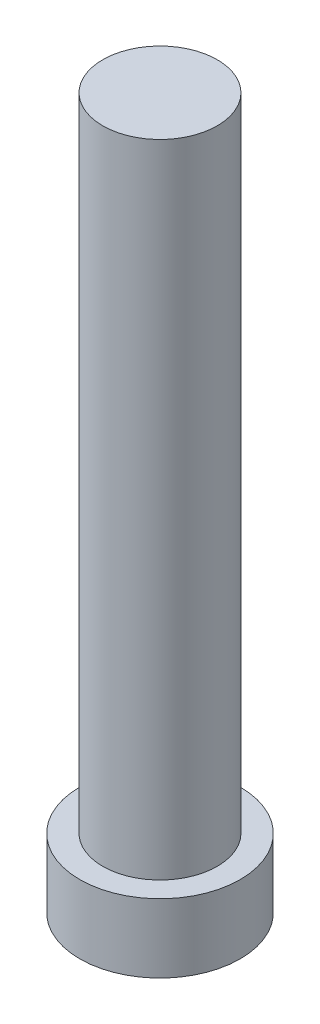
ISO-10303-21;
HEADER;
FILE_DESCRIPTION(('STEP AP214'),'2;1');
FILE_NAME('part.step','',(''),(''),'','','');
FILE_SCHEMA(('AUTOMOTIVE_DESIGN { 1 0 10303 214 1 1 1 1 }'));
ENDSEC;
DATA;
#1=APPLICATION_CONTEXT('core data for automotive mechanical design processes');
#2=APPLICATION_PROTOCOL_DEFINITION('international standard','automotive_design',2000,#1);
#3=PRODUCT_CONTEXT('',#1,'mechanical');
#4=PRODUCT('Part','Part','',(#3));
#5=PRODUCT_RELATED_PRODUCT_CATEGORY('part','',(#4));
#6=PRODUCT_DEFINITION_FORMATION('','',#4);
#7=PRODUCT_DEFINITION_CONTEXT('part definition',#1,'design');
#8=PRODUCT_DEFINITION('design','',#6,#7);
#9=PRODUCT_DEFINITION_SHAPE('','',#8);
#10=(LENGTH_UNIT() NAMED_UNIT(*) SI_UNIT(.MILLI.,.METRE.));
#11=(NAMED_UNIT(*) PLANE_ANGLE_UNIT() SI_UNIT($,.RADIAN.));
#12=(NAMED_UNIT(*) SI_UNIT($,.STERADIAN.) SOLID_ANGLE_UNIT());
#13=UNCERTAINTY_MEASURE_WITH_UNIT(LENGTH_MEASURE(1.E-05),#10,'distance_accuracy_value','');
#14=(GEOMETRIC_REPRESENTATION_CONTEXT(3) GLOBAL_UNCERTAINTY_ASSIGNED_CONTEXT((#13)) GLOBAL_UNIT_ASSIGNED_CONTEXT((#10,
#11,#12)) REPRESENTATION_CONTEXT('',''));
#15=CARTESIAN_POINT('',(0.,0.,0.));
#16=DIRECTION('',(0.,0.,1.));
#17=DIRECTION('',(1.,0.,0.));
#18=AXIS2_PLACEMENT_3D('',#15,#16,#17);
#19=CARTESIAN_POINT('',(-4.99999999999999,62.,0.));
#20=DIRECTION('',(0.,1.,0.));
#21=DIRECTION('',(0.,0.,1.));
#22=AXIS2_PLACEMENT_3D('',#19,#20,#21);
#23=PLANE('',#22);
#24=CARTESIAN_POINT('',(0.,62.,0.));
#25=DIRECTION('',(0.,1.,0.));
#26=DIRECTION('',(0.,0.,1.));
#27=AXIS2_PLACEMENT_3D('',#24,#25,#26);
#28=CIRCLE('',#27,4.99999999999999);
#29=CARTESIAN_POINT('',(0.,62.,4.99999999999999));
#30=VERTEX_POINT('',#29);
#31=EDGE_CURVE('E10',#30,#30,#28,.T.);
#32=ORIENTED_EDGE('',*,*,#31,.T.);
#33=EDGE_LOOP('',(#32));
#34=FACE_BOUND('',#33,.T.);
#35=ADVANCED_FACE('F30',(#34),#23,.T.);
#36=CARTESIAN_POINT('',(0.,49.4323076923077,0.));
#37=DIRECTION('',(0.,1.,0.));
#38=DIRECTION('',(0.,0.,1.));
#39=AXIS2_PLACEMENT_3D('',#36,#37,#38);
#40=CYLINDRICAL_SURFACE('',#39,4.99999999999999);
#41=CARTESIAN_POINT('',(0.,6.,0.));
#42=DIRECTION('',(0.,1.,0.));
#43=DIRECTION('',(0.,0.,1.));
#44=AXIS2_PLACEMENT_3D('',#41,#42,#43);
#45=CIRCLE('',#44,4.99999999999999);
#46=CARTESIAN_POINT('',(0.,6.,4.99999999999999));
#47=VERTEX_POINT('',#46);
#48=EDGE_CURVE('E36',#47,#47,#45,.T.);
#49=ORIENTED_EDGE('',*,*,#48,.T.);
#50=EDGE_LOOP('',(#49));
#51=FACE_BOUND('',#50,.T.);
#52=ORIENTED_EDGE('',*,*,#31,.F.);
#53=EDGE_LOOP('',(#52));
#54=FACE_BOUND('',#53,.T.);
#55=ADVANCED_FACE('F62',(#51,#54),#40,.T.);
#56=CARTESIAN_POINT('',(-7.,6.,0.));
#57=DIRECTION('',(0.,1.,0.));
#58=DIRECTION('',(0.,0.,1.));
#59=AXIS2_PLACEMENT_3D('',#56,#57,#58);
#60=PLANE('',#59);
#61=CARTESIAN_POINT('',(0.,6.,0.));
#62=DIRECTION('',(0.,1.,0.));
#63=DIRECTION('',(0.,0.,1.));
#64=AXIS2_PLACEMENT_3D('',#61,#62,#63);
#65=CIRCLE('',#64,7.);
#66=CARTESIAN_POINT('',(0.,6.,7.));
#67=VERTEX_POINT('',#66);
#68=EDGE_CURVE('E40',#67,#67,#65,.T.);
#69=ORIENTED_EDGE('',*,*,#68,.T.);
#70=EDGE_LOOP('',(#69));
#71=FACE_BOUND('',#70,.T.);
#72=ORIENTED_EDGE('',*,*,#48,.F.);
#73=EDGE_LOOP('',(#72));
#74=FACE_BOUND('',#73,.T.);
#75=ADVANCED_FACE('F59',(#71,#74),#60,.T.);
#76=CARTESIAN_POINT('',(0.,49.4323076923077,0.));
#77=DIRECTION('',(0.,1.,0.));
#78=DIRECTION('',(0.,0.,1.));
#79=AXIS2_PLACEMENT_3D('',#76,#77,#78);
#80=CYLINDRICAL_SURFACE('',#79,7.);
#81=CARTESIAN_POINT('',(0.,0.,0.));
#82=DIRECTION('',(0.,1.,0.));
#83=DIRECTION('',(0.,0.,1.));
#84=AXIS2_PLACEMENT_3D('',#81,#82,#83);
#85=CIRCLE('',#84,6.99999999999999);
#86=CARTESIAN_POINT('',(0.,0.,6.99999999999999));
#87=VERTEX_POINT('',#86);
#88=EDGE_CURVE('E44',#87,#87,#85,.T.);
#89=ORIENTED_EDGE('',*,*,#88,.T.);
#90=EDGE_LOOP('',(#89));
#91=FACE_BOUND('',#90,.T.);
#92=ORIENTED_EDGE('',*,*,#68,.F.);
#93=EDGE_LOOP('',(#92));
#94=FACE_BOUND('',#93,.T.);
#95=ADVANCED_FACE('F50',(#91,#94),#80,.T.);
#96=CARTESIAN_POINT('',(0.,0.,0.));
#97=DIRECTION('',(0.,-1.,0.));
#98=DIRECTION('',(0.,0.,-1.));
#99=AXIS2_PLACEMENT_3D('',#96,#97,#98);
#100=PLANE('',#99);
#101=ORIENTED_EDGE('',*,*,#88,.F.);
#102=EDGE_LOOP('',(#101));
#103=FACE_BOUND('',#102,.T.);
#104=ADVANCED_FACE('F53',(#103),#100,.T.);
#105=CLOSED_SHELL('',(#35,#55,#75,#95,#104));
#106=MANIFOLD_SOLID_BREP('B2',#105);
#107=ADVANCED_BREP_SHAPE_REPRESENTATION('',(#18,#106),#14);
#108=SHAPE_DEFINITION_REPRESENTATION(#9,#107);
ENDSEC;
END-ISO-10303-21;
